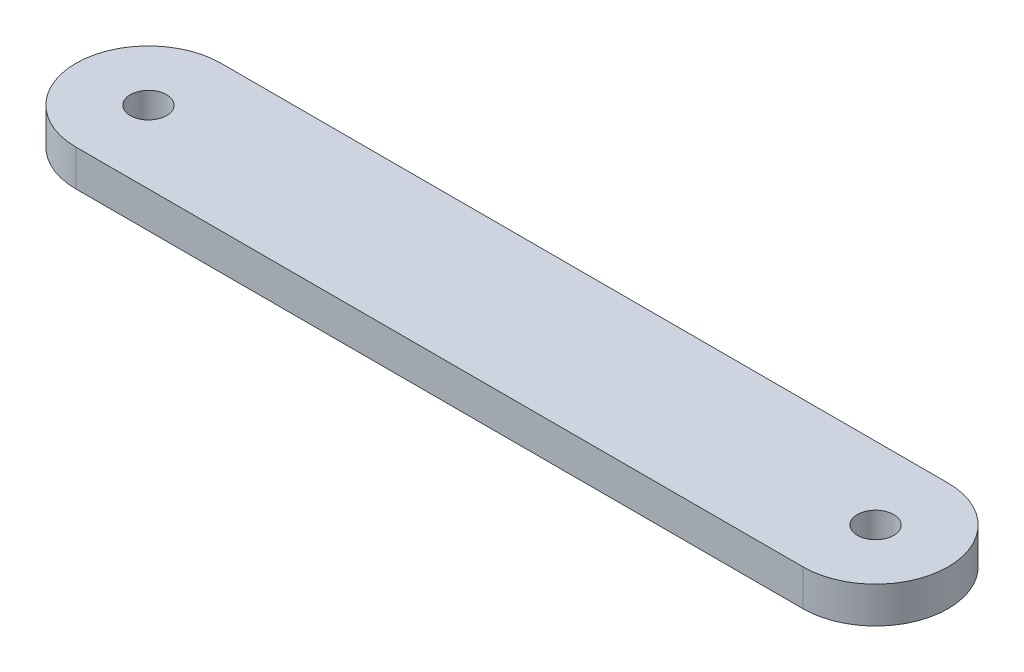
ISO-10303-21;
HEADER;
FILE_DESCRIPTION(('STEP AP214'),'2;1');
FILE_NAME('part.step','',(''),(''),'','','');
FILE_SCHEMA(('AUTOMOTIVE_DESIGN { 1 0 10303 214 1 1 1 1 }'));
ENDSEC;
DATA;
#1=APPLICATION_CONTEXT('core data for automotive mechanical design processes');
#2=APPLICATION_PROTOCOL_DEFINITION('international standard','automotive_design',2000,#1);
#3=PRODUCT_CONTEXT('',#1,'mechanical');
#4=PRODUCT('Part','Part','',(#3));
#5=PRODUCT_RELATED_PRODUCT_CATEGORY('part','',(#4));
#6=PRODUCT_DEFINITION_FORMATION('','',#4);
#7=PRODUCT_DEFINITION_CONTEXT('part definition',#1,'design');
#8=PRODUCT_DEFINITION('design','',#6,#7);
#9=PRODUCT_DEFINITION_SHAPE('','',#8);
#10=(LENGTH_UNIT() NAMED_UNIT(*) SI_UNIT(.MILLI.,.METRE.));
#11=(NAMED_UNIT(*) PLANE_ANGLE_UNIT() SI_UNIT($,.RADIAN.));
#12=(NAMED_UNIT(*) SI_UNIT($,.STERADIAN.) SOLID_ANGLE_UNIT());
#13=UNCERTAINTY_MEASURE_WITH_UNIT(LENGTH_MEASURE(1.E-05),#10,'distance_accuracy_value','');
#14=(GEOMETRIC_REPRESENTATION_CONTEXT(3) GLOBAL_UNCERTAINTY_ASSIGNED_CONTEXT((#13)) GLOBAL_UNIT_ASSIGNED_CONTEXT((#10,
#11,#12)) REPRESENTATION_CONTEXT('',''));
#15=CARTESIAN_POINT('',(0.,0.,0.));
#16=DIRECTION('',(0.,0.,1.));
#17=DIRECTION('',(1.,0.,0.));
#18=AXIS2_PLACEMENT_3D('',#15,#16,#17);
#19=CARTESIAN_POINT('',(0.,6.35,0.));
#20=DIRECTION('',(0.,-1.,0.));
#21=DIRECTION('',(0.,0.,-1.));
#22=AXIS2_PLACEMENT_3D('',#19,#20,#21);
#23=CYLINDRICAL_SURFACE('',#22,12.7);
#24=CARTESIAN_POINT('',(0.,0.,0.));
#25=DIRECTION('',(0.,1.,0.));
#26=DIRECTION('',(0.,0.,1.));
#27=AXIS2_PLACEMENT_3D('',#24,#25,#26);
#28=CIRCLE('',#27,12.7);
#29=CARTESIAN_POINT('',(0.,0.,-12.7));
#30=VERTEX_POINT('',#29);
#31=CARTESIAN_POINT('',(0.,0.,12.7));
#32=VERTEX_POINT('',#31);
#33=EDGE_CURVE('E106',#30,#32,#28,.T.);
#34=ORIENTED_EDGE('',*,*,#33,.T.);
#35=DIRECTION('',(0.,-1.,0.));
#36=VECTOR('',#35,1.);
#37=CARTESIAN_POINT('',(0.,6.35,12.7));
#38=LINE('',#37,#36);
#39=CARTESIAN_POINT('',(0.,6.35,12.7));
#40=VERTEX_POINT('',#39);
#41=EDGE_CURVE('E11',#40,#32,#38,.T.);
#42=ORIENTED_EDGE('',*,*,#41,.F.);
#43=CARTESIAN_POINT('',(0.,6.35,0.));
#44=DIRECTION('',(0.,1.,0.));
#45=DIRECTION('',(0.,0.,1.));
#46=AXIS2_PLACEMENT_3D('',#43,#44,#45);
#47=CIRCLE('',#46,12.7);
#48=CARTESIAN_POINT('',(0.,6.35,-12.7));
#49=VERTEX_POINT('',#48);
#50=EDGE_CURVE('E86',#49,#40,#47,.T.);
#51=ORIENTED_EDGE('',*,*,#50,.F.);
#52=DIRECTION('',(0.,-1.,0.));
#53=VECTOR('',#52,1.);
#54=CARTESIAN_POINT('',(0.,6.35,-12.7));
#55=LINE('',#54,#53);
#56=EDGE_CURVE('E52',#49,#30,#55,.T.);
#57=ORIENTED_EDGE('',*,*,#56,.T.);
#58=EDGE_LOOP('',(#34,#42,#51,#57));
#59=FACE_BOUND('',#58,.T.);
#60=ADVANCED_FACE('F35',(#59),#23,.T.);
#61=CARTESIAN_POINT('',(0.,6.35,12.7));
#62=DIRECTION('',(0.,0.,-1.));
#63=DIRECTION('',(-1.,0.,0.));
#64=AXIS2_PLACEMENT_3D('',#61,#62,#63);
#65=PLANE('',#64);
#66=DIRECTION('',(1.,0.,0.));
#67=VECTOR('',#66,1.);
#68=CARTESIAN_POINT('',(0.,0.,12.7));
#69=LINE('',#68,#67);
#70=CARTESIAN_POINT('',(127.254,0.,12.7));
#71=VERTEX_POINT('',#70);
#72=EDGE_CURVE('E91',#32,#71,#69,.T.);
#73=ORIENTED_EDGE('',*,*,#72,.T.);
#74=DIRECTION('',(0.,-1.,0.));
#75=VECTOR('',#74,1.);
#76=CARTESIAN_POINT('',(127.254,6.35,12.7));
#77=LINE('',#76,#75);
#78=CARTESIAN_POINT('',(127.254,6.35,12.7));
#79=VERTEX_POINT('',#78);
#80=EDGE_CURVE('E44',#79,#71,#77,.T.);
#81=ORIENTED_EDGE('',*,*,#80,.F.);
#82=DIRECTION('',(1.,0.,0.));
#83=VECTOR('',#82,1.);
#84=CARTESIAN_POINT('',(0.,6.35,12.7));
#85=LINE('',#84,#83);
#86=EDGE_CURVE('E78',#40,#79,#85,.T.);
#87=ORIENTED_EDGE('',*,*,#86,.F.);
#88=ORIENTED_EDGE('',*,*,#41,.T.);
#89=EDGE_LOOP('',(#73,#81,#87,#88));
#90=FACE_BOUND('',#89,.T.);
#91=ADVANCED_FACE('F90',(#90),#65,.F.);
#92=CARTESIAN_POINT('',(127.254,6.35,0.));
#93=DIRECTION('',(0.,-1.,0.));
#94=DIRECTION('',(0.,0.,-1.));
#95=AXIS2_PLACEMENT_3D('',#92,#93,#94);
#96=CYLINDRICAL_SURFACE('',#95,12.7);
#97=CARTESIAN_POINT('',(127.254,0.,0.));
#98=DIRECTION('',(0.,1.,0.));
#99=DIRECTION('',(0.,0.,1.));
#100=AXIS2_PLACEMENT_3D('',#97,#98,#99);
#101=CIRCLE('',#100,12.7);
#102=CARTESIAN_POINT('',(127.254,0.,-12.7));
#103=VERTEX_POINT('',#102);
#104=EDGE_CURVE('E109',#71,#103,#101,.T.);
#105=ORIENTED_EDGE('',*,*,#104,.T.);
#106=DIRECTION('',(0.,-1.,0.));
#107=VECTOR('',#106,1.);
#108=CARTESIAN_POINT('',(127.254,6.35,-12.7));
#109=LINE('',#108,#107);
#110=CARTESIAN_POINT('',(127.254,6.35,-12.7));
#111=VERTEX_POINT('',#110);
#112=EDGE_CURVE('E67',#111,#103,#109,.T.);
#113=ORIENTED_EDGE('',*,*,#112,.F.);
#114=CARTESIAN_POINT('',(127.254,6.35,0.));
#115=DIRECTION('',(0.,1.,0.));
#116=DIRECTION('',(0.,0.,1.));
#117=AXIS2_PLACEMENT_3D('',#114,#115,#116);
#118=CIRCLE('',#117,12.7);
#119=EDGE_CURVE('E85',#79,#111,#118,.T.);
#120=ORIENTED_EDGE('',*,*,#119,.F.);
#121=ORIENTED_EDGE('',*,*,#80,.T.);
#122=EDGE_LOOP('',(#105,#113,#120,#121));
#123=FACE_BOUND('',#122,.T.);
#124=ADVANCED_FACE('F94',(#123),#96,.T.);
#125=CARTESIAN_POINT('',(0.,6.35,-12.7));
#126=DIRECTION('',(0.,0.,-1.));
#127=DIRECTION('',(-1.,0.,0.));
#128=AXIS2_PLACEMENT_3D('',#125,#126,#127);
#129=PLANE('',#128);
#130=DIRECTION('',(1.,0.,0.));
#131=VECTOR('',#130,1.);
#132=CARTESIAN_POINT('',(0.,0.,-12.7));
#133=LINE('',#132,#131);
#134=EDGE_CURVE('E111',#30,#103,#133,.T.);
#135=ORIENTED_EDGE('',*,*,#134,.F.);
#136=ORIENTED_EDGE('',*,*,#56,.F.);
#137=DIRECTION('',(1.,0.,0.));
#138=VECTOR('',#137,1.);
#139=CARTESIAN_POINT('',(0.,6.35,-12.7));
#140=LINE('',#139,#138);
#141=EDGE_CURVE('E95',#49,#111,#140,.T.);
#142=ORIENTED_EDGE('',*,*,#141,.T.);
#143=ORIENTED_EDGE('',*,*,#112,.T.);
#144=EDGE_LOOP('',(#135,#136,#142,#143));
#145=FACE_BOUND('',#144,.T.);
#146=ADVANCED_FACE('F147',(#145),#129,.T.);
#147=CARTESIAN_POINT('',(0.,6.35,0.));
#148=DIRECTION('',(0.,-1.,0.));
#149=DIRECTION('',(0.,0.,-1.));
#150=AXIS2_PLACEMENT_3D('',#147,#148,#149);
#151=CYLINDRICAL_SURFACE('',#150,3.175);
#152=CARTESIAN_POINT('',(0.,6.35,0.));
#153=DIRECTION('',(0.,1.,0.));
#154=DIRECTION('',(0.,0.,1.));
#155=AXIS2_PLACEMENT_3D('',#152,#153,#154);
#156=CIRCLE('',#155,3.175);
#157=CARTESIAN_POINT('',(0.,6.35,3.175));
#158=VERTEX_POINT('',#157);
#159=EDGE_CURVE('E117',#158,#158,#156,.T.);
#160=ORIENTED_EDGE('',*,*,#159,.T.);
#161=EDGE_LOOP('',(#160));
#162=FACE_BOUND('',#161,.T.);
#163=CARTESIAN_POINT('',(0.,0.,0.));
#164=DIRECTION('',(0.,1.,0.));
#165=DIRECTION('',(0.,0.,1.));
#166=AXIS2_PLACEMENT_3D('',#163,#164,#165);
#167=CIRCLE('',#166,3.175);
#168=CARTESIAN_POINT('',(0.,0.,3.175));
#169=VERTEX_POINT('',#168);
#170=EDGE_CURVE('E103',#169,#169,#167,.T.);
#171=ORIENTED_EDGE('',*,*,#170,.F.);
#172=EDGE_LOOP('',(#171));
#173=FACE_BOUND('',#172,.T.);
#174=ADVANCED_FACE('F37',(#162,#173),#151,.F.);
#175=CARTESIAN_POINT('',(127.254,6.35,0.));
#176=DIRECTION('',(0.,-1.,0.));
#177=DIRECTION('',(0.,0.,-1.));
#178=AXIS2_PLACEMENT_3D('',#175,#176,#177);
#179=CYLINDRICAL_SURFACE('',#178,3.175);
#180=CARTESIAN_POINT('',(127.254,6.35,0.));
#181=DIRECTION('',(0.,1.,0.));
#182=DIRECTION('',(0.,0.,1.));
#183=AXIS2_PLACEMENT_3D('',#180,#181,#182);
#184=CIRCLE('',#183,3.175);
#185=CARTESIAN_POINT('',(127.254,6.35,3.17499999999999));
#186=VERTEX_POINT('',#185);
#187=EDGE_CURVE('E97',#186,#186,#184,.T.);
#188=ORIENTED_EDGE('',*,*,#187,.T.);
#189=EDGE_LOOP('',(#188));
#190=FACE_BOUND('',#189,.T.);
#191=CARTESIAN_POINT('',(127.254,0.,0.));
#192=DIRECTION('',(0.,1.,0.));
#193=DIRECTION('',(0.,0.,1.));
#194=AXIS2_PLACEMENT_3D('',#191,#192,#193);
#195=CIRCLE('',#194,3.175);
#196=CARTESIAN_POINT('',(127.254,0.,3.17499999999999));
#197=VERTEX_POINT('',#196);
#198=EDGE_CURVE('E114',#197,#197,#195,.T.);
#199=ORIENTED_EDGE('',*,*,#198,.F.);
#200=EDGE_LOOP('',(#199));
#201=FACE_BOUND('',#200,.T.);
#202=ADVANCED_FACE('F129',(#190,#201),#179,.F.);
#203=CARTESIAN_POINT('',(0.,6.35,0.));
#204=DIRECTION('',(0.,1.,0.));
#205=DIRECTION('',(0.,0.,1.));
#206=AXIS2_PLACEMENT_3D('',#203,#204,#205);
#207=PLANE('',#206);
#208=ORIENTED_EDGE('',*,*,#159,.F.);
#209=EDGE_LOOP('',(#208));
#210=FACE_BOUND('',#209,.T.);
#211=ORIENTED_EDGE('',*,*,#50,.T.);
#212=ORIENTED_EDGE('',*,*,#86,.T.);
#213=ORIENTED_EDGE('',*,*,#119,.T.);
#214=ORIENTED_EDGE('',*,*,#141,.F.);
#215=EDGE_LOOP('',(#211,#212,#213,#214));
#216=FACE_BOUND('',#215,.T.);
#217=ORIENTED_EDGE('',*,*,#187,.F.);
#218=EDGE_LOOP('',(#217));
#219=FACE_BOUND('',#218,.T.);
#220=ADVANCED_FACE('F81',(#210,#216,#219),#207,.T.);
#221=CARTESIAN_POINT('',(0.,0.,0.));
#222=DIRECTION('',(0.,1.,0.));
#223=DIRECTION('',(0.,0.,1.));
#224=AXIS2_PLACEMENT_3D('',#221,#222,#223);
#225=PLANE('',#224);
#226=ORIENTED_EDGE('',*,*,#170,.T.);
#227=EDGE_LOOP('',(#226));
#228=FACE_BOUND('',#227,.T.);
#229=ORIENTED_EDGE('',*,*,#33,.F.);
#230=ORIENTED_EDGE('',*,*,#134,.T.);
#231=ORIENTED_EDGE('',*,*,#104,.F.);
#232=ORIENTED_EDGE('',*,*,#72,.F.);
#233=EDGE_LOOP('',(#229,#230,#231,#232));
#234=FACE_BOUND('',#233,.T.);
#235=ORIENTED_EDGE('',*,*,#198,.T.);
#236=EDGE_LOOP('',(#235));
#237=FACE_BOUND('',#236,.T.);
#238=ADVANCED_FACE('F128',(#228,#234,#237),#225,.F.);
#239=CLOSED_SHELL('',(#60,#91,#124,#146,#174,#202,#220,#238));
#240=MANIFOLD_SOLID_BREP('B2',#239);
#241=ADVANCED_BREP_SHAPE_REPRESENTATION('',(#18,#240),#14);
#242=SHAPE_DEFINITION_REPRESENTATION(#9,#241);
ENDSEC;
END-ISO-10303-21;
